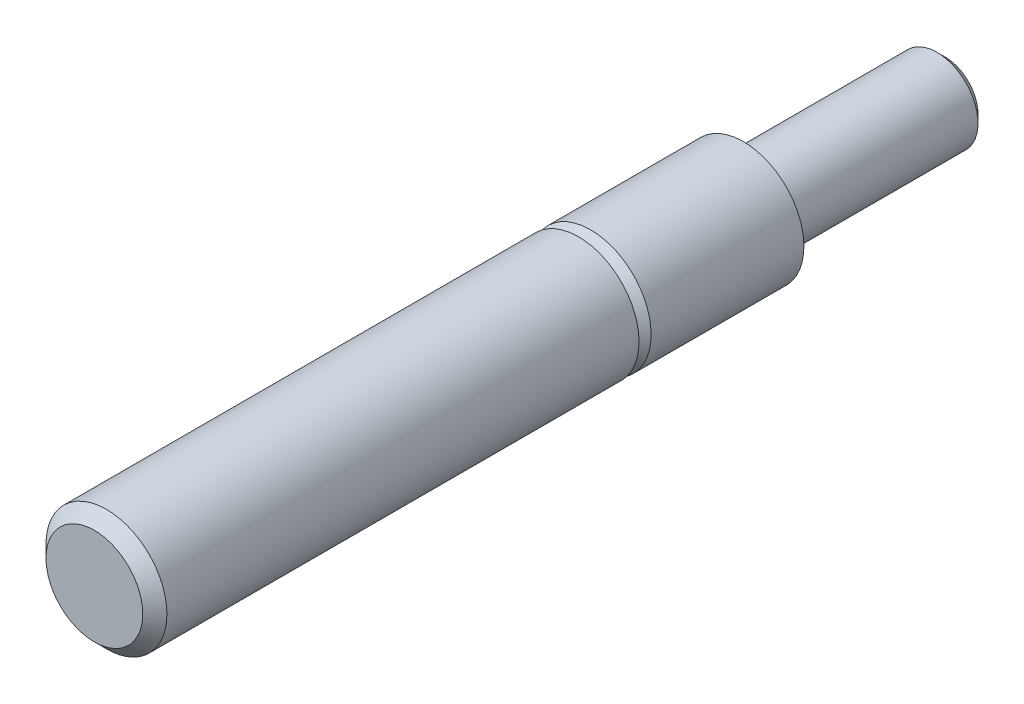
from build123d import *


with BuildPart() as part:
    # Sketch1 → Revolve1 (revolve)
    with BuildSketch(Plane(origin=(0, 0, 0), x_dir=(0, 0, -1), z_dir=(1, 0, 0)), mode=Mode.PRIVATE) as revolve1_sk:
        Polygon((0, 0), (0, 2.801112), (0.700278, 3.50139), (28.0416, 3.50139), (28.0416, 2.801112), (28.741878, 3.50139), (37.592, 3.50139), (37.592, 2.13741), (38.06698, 2.3749), (48.80102, 2.3749), (49.276, 1.89992), (49.276, 0), align=None)
    revolve(revolve1_sk.sketch.rotate(Axis((0, 0, 0), (0, 0, -1)), 90), axis=Axis((0, 0, 0), (0, 0, -1)))


solid = part.part
